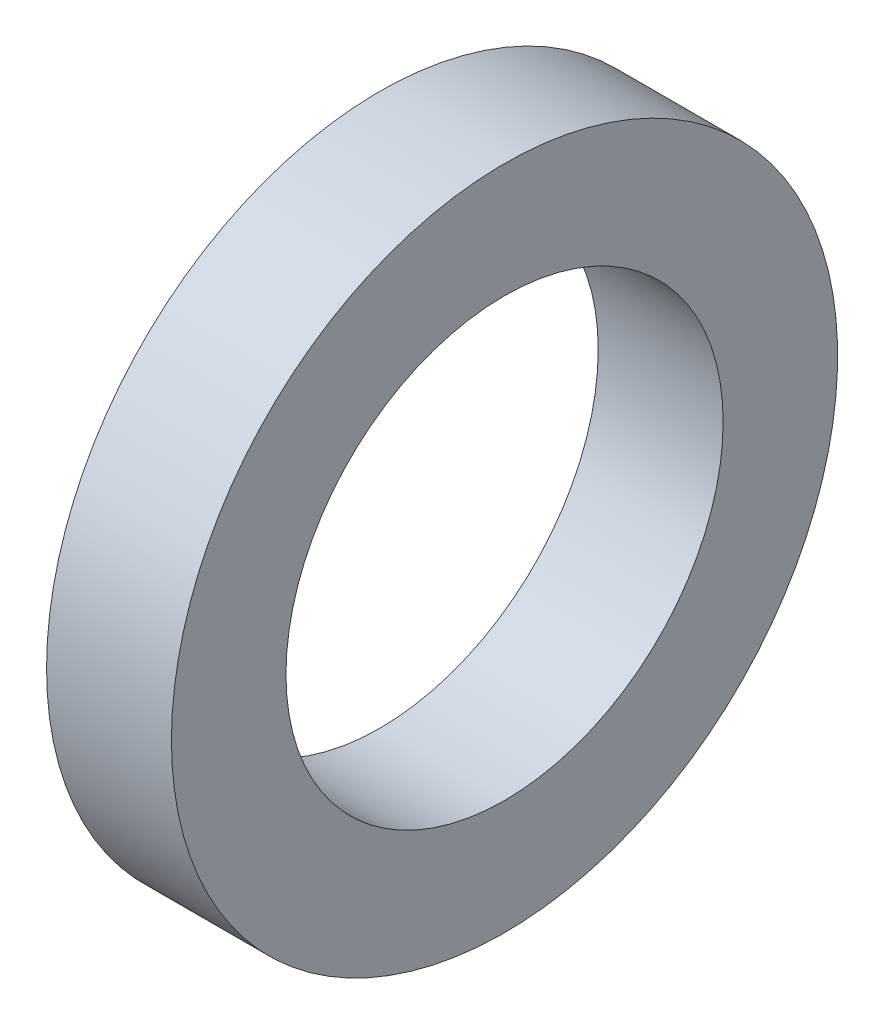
ISO-10303-21;
HEADER;
FILE_DESCRIPTION(('STEP AP214'),'2;1');
FILE_NAME('part.step','',(''),(''),'','','');
FILE_SCHEMA(('AUTOMOTIVE_DESIGN { 1 0 10303 214 1 1 1 1 }'));
ENDSEC;
DATA;
#1=APPLICATION_CONTEXT('core data for automotive mechanical design processes');
#2=APPLICATION_PROTOCOL_DEFINITION('international standard','automotive_design',2000,#1);
#3=PRODUCT_CONTEXT('',#1,'mechanical');
#4=PRODUCT('Part','Part','',(#3));
#5=PRODUCT_RELATED_PRODUCT_CATEGORY('part','',(#4));
#6=PRODUCT_DEFINITION_FORMATION('','',#4);
#7=PRODUCT_DEFINITION_CONTEXT('part definition',#1,'design');
#8=PRODUCT_DEFINITION('design','',#6,#7);
#9=PRODUCT_DEFINITION_SHAPE('','',#8);
#10=(LENGTH_UNIT() NAMED_UNIT(*) SI_UNIT(.MILLI.,.METRE.));
#11=(NAMED_UNIT(*) PLANE_ANGLE_UNIT() SI_UNIT($,.RADIAN.));
#12=(NAMED_UNIT(*) SI_UNIT($,.STERADIAN.) SOLID_ANGLE_UNIT());
#13=UNCERTAINTY_MEASURE_WITH_UNIT(LENGTH_MEASURE(1.E-05),#10,'distance_accuracy_value','');
#14=(GEOMETRIC_REPRESENTATION_CONTEXT(3) GLOBAL_UNCERTAINTY_ASSIGNED_CONTEXT((#13)) GLOBAL_UNIT_ASSIGNED_CONTEXT((#10,
#11,#12)) REPRESENTATION_CONTEXT('',''));
#15=CARTESIAN_POINT('',(0.,0.,0.));
#16=DIRECTION('',(0.,0.,1.));
#17=DIRECTION('',(1.,0.,0.));
#18=AXIS2_PLACEMENT_3D('',#15,#16,#17);
#19=CARTESIAN_POINT('',(0.,0.,-8.));
#20=DIRECTION('',(1.,0.,0.));
#21=DIRECTION('',(0.,0.,-1.));
#22=AXIS2_PLACEMENT_3D('',#19,#20,#21);
#23=PLANE('',#22);
#24=CARTESIAN_POINT('',(0.,0.,0.));
#25=DIRECTION('',(-1.,0.,0.));
#26=DIRECTION('',(0.,0.,1.));
#27=AXIS2_PLACEMENT_3D('',#24,#25,#26);
#28=CIRCLE('',#27,5.25);
#29=CARTESIAN_POINT('',(0.,0.,5.25));
#30=VERTEX_POINT('',#29);
#31=EDGE_CURVE('E10',#30,#30,#28,.T.);
#32=ORIENTED_EDGE('',*,*,#31,.F.);
#33=EDGE_LOOP('',(#32));
#34=FACE_BOUND('',#33,.T.);
#35=CARTESIAN_POINT('',(0.,0.,0.));
#36=DIRECTION('',(-1.,0.,0.));
#37=DIRECTION('',(0.,0.,1.));
#38=AXIS2_PLACEMENT_3D('',#35,#36,#37);
#39=CIRCLE('',#38,8.);
#40=CARTESIAN_POINT('',(0.,0.,8.));
#41=VERTEX_POINT('',#40);
#42=EDGE_CURVE('E44',#41,#41,#39,.T.);
#43=ORIENTED_EDGE('',*,*,#42,.T.);
#44=EDGE_LOOP('',(#43));
#45=FACE_BOUND('',#44,.T.);
#46=ADVANCED_FACE('F30',(#34,#45),#23,.F.);
#47=CARTESIAN_POINT('',(0.,0.,0.));
#48=DIRECTION('',(-1.,0.,0.));
#49=DIRECTION('',(0.,0.,1.));
#50=AXIS2_PLACEMENT_3D('',#47,#48,#49);
#51=CYLINDRICAL_SURFACE('',#50,5.25);
#52=CARTESIAN_POINT('',(3.,0.,0.));
#53=DIRECTION('',(-1.,0.,0.));
#54=DIRECTION('',(0.,0.,1.));
#55=AXIS2_PLACEMENT_3D('',#52,#53,#54);
#56=CIRCLE('',#55,5.25);
#57=CARTESIAN_POINT('',(3.,0.,5.25));
#58=VERTEX_POINT('',#57);
#59=EDGE_CURVE('E36',#58,#58,#56,.T.);
#60=ORIENTED_EDGE('',*,*,#59,.F.);
#61=EDGE_LOOP('',(#60));
#62=FACE_BOUND('',#61,.T.);
#63=ORIENTED_EDGE('',*,*,#31,.T.);
#64=EDGE_LOOP('',(#63));
#65=FACE_BOUND('',#64,.T.);
#66=ADVANCED_FACE('F59',(#62,#65),#51,.F.);
#67=CARTESIAN_POINT('',(3.,0.,-8.));
#68=DIRECTION('',(-1.,0.,0.));
#69=DIRECTION('',(0.,0.,1.));
#70=AXIS2_PLACEMENT_3D('',#67,#68,#69);
#71=PLANE('',#70);
#72=CARTESIAN_POINT('',(3.,0.,0.));
#73=DIRECTION('',(-1.,0.,0.));
#74=DIRECTION('',(0.,0.,1.));
#75=AXIS2_PLACEMENT_3D('',#72,#73,#74);
#76=CIRCLE('',#75,8.);
#77=CARTESIAN_POINT('',(3.,0.,8.));
#78=VERTEX_POINT('',#77);
#79=EDGE_CURVE('E40',#78,#78,#76,.T.);
#80=ORIENTED_EDGE('',*,*,#79,.F.);
#81=EDGE_LOOP('',(#80));
#82=FACE_BOUND('',#81,.T.);
#83=ORIENTED_EDGE('',*,*,#59,.T.);
#84=EDGE_LOOP('',(#83));
#85=FACE_BOUND('',#84,.T.);
#86=ADVANCED_FACE('F54',(#82,#85),#71,.F.);
#87=CARTESIAN_POINT('',(0.,0.,0.));
#88=DIRECTION('',(-1.,0.,0.));
#89=DIRECTION('',(0.,0.,1.));
#90=AXIS2_PLACEMENT_3D('',#87,#88,#89);
#91=CYLINDRICAL_SURFACE('',#90,8.);
#92=ORIENTED_EDGE('',*,*,#42,.F.);
#93=EDGE_LOOP('',(#92));
#94=FACE_BOUND('',#93,.T.);
#95=ORIENTED_EDGE('',*,*,#79,.T.);
#96=EDGE_LOOP('',(#95));
#97=FACE_BOUND('',#96,.T.);
#98=ADVANCED_FACE('F51',(#94,#97),#91,.T.);
#99=CLOSED_SHELL('',(#46,#66,#86,#98));
#100=MANIFOLD_SOLID_BREP('B2',#99);
#101=ADVANCED_BREP_SHAPE_REPRESENTATION('',(#18,#100),#14);
#102=SHAPE_DEFINITION_REPRESENTATION(#9,#101);
ENDSEC;
END-ISO-10303-21;
